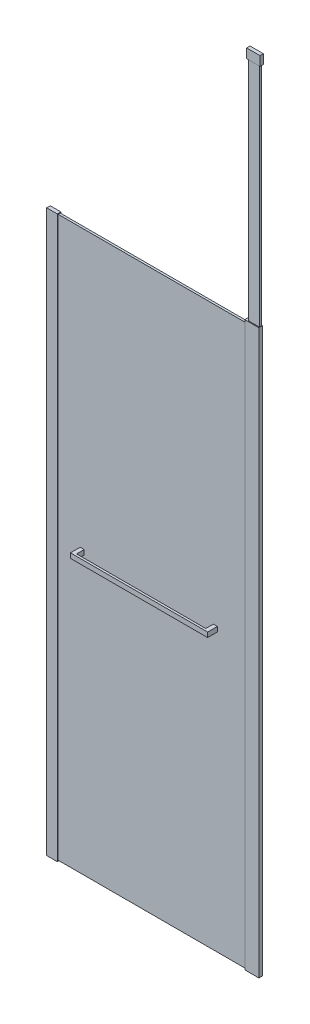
ISO-10303-21;
HEADER;
FILE_DESCRIPTION(('STEP AP214'),'2;1');
FILE_NAME('part.step','',(''),(''),'','','');
FILE_SCHEMA(('AUTOMOTIVE_DESIGN { 1 0 10303 214 1 1 1 1 }'));
ENDSEC;
DATA;
#1=APPLICATION_CONTEXT('core data for automotive mechanical design processes');
#2=APPLICATION_PROTOCOL_DEFINITION('international standard','automotive_design',2000,#1);
#3=PRODUCT_CONTEXT('',#1,'mechanical');
#4=PRODUCT('Part','Part','',(#3));
#5=PRODUCT_RELATED_PRODUCT_CATEGORY('part','',(#4));
#6=PRODUCT_DEFINITION_FORMATION('','',#4);
#7=PRODUCT_DEFINITION_CONTEXT('part definition',#1,'design');
#8=PRODUCT_DEFINITION('design','',#6,#7);
#9=PRODUCT_DEFINITION_SHAPE('','',#8);
#10=(LENGTH_UNIT() NAMED_UNIT(*) SI_UNIT(.MILLI.,.METRE.));
#11=(NAMED_UNIT(*) PLANE_ANGLE_UNIT() SI_UNIT($,.RADIAN.));
#12=(NAMED_UNIT(*) SI_UNIT($,.STERADIAN.) SOLID_ANGLE_UNIT());
#13=UNCERTAINTY_MEASURE_WITH_UNIT(LENGTH_MEASURE(1.E-05),#10,'distance_accuracy_value','');
#14=(GEOMETRIC_REPRESENTATION_CONTEXT(3) GLOBAL_UNCERTAINTY_ASSIGNED_CONTEXT((#13)) GLOBAL_UNIT_ASSIGNED_CONTEXT((#10,
#11,#12)) REPRESENTATION_CONTEXT('',''));
#15=CARTESIAN_POINT('',(0.,0.,0.));
#16=DIRECTION('',(0.,0.,1.));
#17=DIRECTION('',(1.,0.,0.));
#18=AXIS2_PLACEMENT_3D('',#15,#16,#17);
#19=CARTESIAN_POINT('',(137.5,1062.,-21.4));
#20=DIRECTION('',(1.,0.,0.));
#21=DIRECTION('',(0.,0.,-1.));
#22=AXIS2_PLACEMENT_3D('',#19,#20,#21);
#23=PLANE('',#22);
#24=DIRECTION('',(0.,1.,0.));
#25=VECTOR('',#24,1.);
#26=CARTESIAN_POINT('',(137.5,1062.,25.1));
#27=LINE('',#26,#25);
#28=CARTESIAN_POINT('',(137.5,1044.,25.1));
#29=VERTEX_POINT('',#28);
#30=CARTESIAN_POINT('',(137.5,1062.,25.1));
#31=VERTEX_POINT('',#30);
#32=EDGE_CURVE('E63',#29,#31,#27,.T.);
#33=ORIENTED_EDGE('',*,*,#32,.F.);
#34=DIRECTION('',(0.,0.,1.));
#35=VECTOR('',#34,1.);
#36=CARTESIAN_POINT('',(137.5,1044.,-21.4));
#37=LINE('',#36,#35);
#38=CARTESIAN_POINT('',(137.5,1044.,-21.4));
#39=VERTEX_POINT('',#38);
#40=EDGE_CURVE('E12',#39,#29,#37,.T.);
#41=ORIENTED_EDGE('',*,*,#40,.F.);
#42=DIRECTION('',(0.,1.,0.));
#43=VECTOR('',#42,1.);
#44=CARTESIAN_POINT('',(137.5,1062.,-21.4));
#45=LINE('',#44,#43);
#46=CARTESIAN_POINT('',(137.5,1062.,-21.4));
#47=VERTEX_POINT('',#46);
#48=EDGE_CURVE('E193',#39,#47,#45,.T.);
#49=ORIENTED_EDGE('',*,*,#48,.T.);
#50=DIRECTION('',(0.,0.,1.));
#51=VECTOR('',#50,1.);
#52=CARTESIAN_POINT('',(137.5,1062.,-21.4));
#53=LINE('',#52,#51);
#54=EDGE_CURVE('E176',#47,#31,#53,.T.);
#55=ORIENTED_EDGE('',*,*,#54,.T.);
#56=EDGE_LOOP('',(#33,#41,#49,#55));
#57=FACE_BOUND('',#56,.T.);
#58=ADVANCED_FACE('F46',(#57),#23,.T.);
#59=CARTESIAN_POINT('',(122.5,1044.,-21.4));
#60=DIRECTION('',(0.,-1.,0.));
#61=DIRECTION('',(0.,0.,-1.));
#62=AXIS2_PLACEMENT_3D('',#59,#60,#61);
#63=PLANE('',#62);
#64=ORIENTED_EDGE('',*,*,#40,.T.);
#65=DIRECTION('',(-1.,0.,0.));
#66=VECTOR('',#65,1.);
#67=CARTESIAN_POINT('',(642.197715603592,1044.,25.1));
#68=LINE('',#67,#66);
#69=CARTESIAN_POINT('',(622.5,1044.,25.1));
#70=VERTEX_POINT('',#69);
#71=EDGE_CURVE('E166',#70,#29,#68,.T.);
#72=ORIENTED_EDGE('',*,*,#71,.F.);
#73=DIRECTION('',(0.,0.,1.));
#74=VECTOR('',#73,1.);
#75=CARTESIAN_POINT('',(622.5,1044.,-21.4));
#76=LINE('',#75,#74);
#77=CARTESIAN_POINT('',(622.5,1044.,-21.4));
#78=VERTEX_POINT('',#77);
#79=EDGE_CURVE('E149',#78,#70,#76,.T.);
#80=ORIENTED_EDGE('',*,*,#79,.F.);
#81=DIRECTION('',(1.,0.,0.));
#82=VECTOR('',#81,1.);
#83=CARTESIAN_POINT('',(622.5,1044.,-21.4));
#84=LINE('',#83,#82);
#85=CARTESIAN_POINT('',(637.5,1044.,-21.4));
#86=VERTEX_POINT('',#85);
#87=EDGE_CURVE('E131',#78,#86,#84,.T.);
#88=ORIENTED_EDGE('',*,*,#87,.T.);
#89=DIRECTION('',(0.,0.,1.));
#90=VECTOR('',#89,1.);
#91=CARTESIAN_POINT('',(637.5,1044.,-21.4));
#92=LINE('',#91,#90);
#93=CARTESIAN_POINT('',(637.5,1044.,33.1));
#94=VERTEX_POINT('',#93);
#95=EDGE_CURVE('E147',#86,#94,#92,.T.);
#96=ORIENTED_EDGE('',*,*,#95,.T.);
#97=DIRECTION('',(1.,0.,0.));
#98=VECTOR('',#97,1.);
#99=CARTESIAN_POINT('',(122.5,1044.,33.1));
#100=LINE('',#99,#98);
#101=CARTESIAN_POINT('',(122.5,1044.,33.1));
#102=VERTEX_POINT('',#101);
#103=EDGE_CURVE('E135',#102,#94,#100,.T.);
#104=ORIENTED_EDGE('',*,*,#103,.F.);
#105=DIRECTION('',(0.,0.,1.));
#106=VECTOR('',#105,1.);
#107=CARTESIAN_POINT('',(122.5,1044.,-21.4));
#108=LINE('',#107,#106);
#109=CARTESIAN_POINT('',(122.5,1044.,-21.4));
#110=VERTEX_POINT('',#109);
#111=EDGE_CURVE('E55',#110,#102,#108,.T.);
#112=ORIENTED_EDGE('',*,*,#111,.F.);
#113=DIRECTION('',(1.,0.,0.));
#114=VECTOR('',#113,1.);
#115=CARTESIAN_POINT('',(122.5,1044.,-21.4));
#116=LINE('',#115,#114);
#117=EDGE_CURVE('E181',#110,#39,#116,.T.);
#118=ORIENTED_EDGE('',*,*,#117,.T.);
#119=EDGE_LOOP('',(#64,#72,#80,#88,#96,#104,#112,#118));
#120=FACE_BOUND('',#119,.T.);
#121=ADVANCED_FACE('F197',(#120),#63,.T.);
#122=CARTESIAN_POINT('',(122.5,1062.,-21.4));
#123=DIRECTION('',(-1.,0.,0.));
#124=DIRECTION('',(0.,0.,1.));
#125=AXIS2_PLACEMENT_3D('',#122,#123,#124);
#126=PLANE('',#125);
#127=ORIENTED_EDGE('',*,*,#111,.T.);
#128=DIRECTION('',(0.,-1.,0.));
#129=VECTOR('',#128,1.);
#130=CARTESIAN_POINT('',(122.5,1062.,33.1));
#131=LINE('',#130,#129);
#132=CARTESIAN_POINT('',(122.5,1062.,33.1));
#133=VERTEX_POINT('',#132);
#134=EDGE_CURVE('E121',#133,#102,#131,.T.);
#135=ORIENTED_EDGE('',*,*,#134,.F.);
#136=DIRECTION('',(0.,0.,1.));
#137=VECTOR('',#136,1.);
#138=CARTESIAN_POINT('',(122.5,1062.,-21.4));
#139=LINE('',#138,#137);
#140=CARTESIAN_POINT('',(122.5,1062.,-21.4));
#141=VERTEX_POINT('',#140);
#142=EDGE_CURVE('E116',#141,#133,#139,.T.);
#143=ORIENTED_EDGE('',*,*,#142,.F.);
#144=DIRECTION('',(0.,-1.,0.));
#145=VECTOR('',#144,1.);
#146=CARTESIAN_POINT('',(122.5,1062.,-21.4));
#147=LINE('',#146,#145);
#148=EDGE_CURVE('E186',#141,#110,#147,.T.);
#149=ORIENTED_EDGE('',*,*,#148,.T.);
#150=EDGE_LOOP('',(#127,#135,#143,#149));
#151=FACE_BOUND('',#150,.T.);
#152=ADVANCED_FACE('F218',(#151),#126,.T.);
#153=CARTESIAN_POINT('',(122.5,1062.,-21.4));
#154=DIRECTION('',(0.,1.,0.));
#155=DIRECTION('',(0.,0.,1.));
#156=AXIS2_PLACEMENT_3D('',#153,#154,#155);
#157=PLANE('',#156);
#158=ORIENTED_EDGE('',*,*,#142,.T.);
#159=DIRECTION('',(-1.,0.,0.));
#160=VECTOR('',#159,1.);
#161=CARTESIAN_POINT('',(122.5,1062.,33.1));
#162=LINE('',#161,#160);
#163=CARTESIAN_POINT('',(637.5,1062.,33.1));
#164=VERTEX_POINT('',#163);
#165=EDGE_CURVE('E109',#164,#133,#162,.T.);
#166=ORIENTED_EDGE('',*,*,#165,.F.);
#167=DIRECTION('',(0.,0.,1.));
#168=VECTOR('',#167,1.);
#169=CARTESIAN_POINT('',(637.5,1062.,-21.4));
#170=LINE('',#169,#168);
#171=CARTESIAN_POINT('',(637.5,1062.,-21.4));
#172=VERTEX_POINT('',#171);
#173=EDGE_CURVE('E113',#172,#164,#170,.T.);
#174=ORIENTED_EDGE('',*,*,#173,.F.);
#175=DIRECTION('',(-1.,0.,0.));
#176=VECTOR('',#175,1.);
#177=CARTESIAN_POINT('',(622.5,1062.,-21.4));
#178=LINE('',#177,#176);
#179=CARTESIAN_POINT('',(622.5,1062.,-21.4));
#180=VERTEX_POINT('',#179);
#181=EDGE_CURVE('E138',#172,#180,#178,.T.);
#182=ORIENTED_EDGE('',*,*,#181,.T.);
#183=DIRECTION('',(0.,0.,1.));
#184=VECTOR('',#183,1.);
#185=CARTESIAN_POINT('',(622.5,1062.,-21.4));
#186=LINE('',#185,#184);
#187=CARTESIAN_POINT('',(622.5,1062.,25.1));
#188=VERTEX_POINT('',#187);
#189=EDGE_CURVE('E130',#180,#188,#186,.T.);
#190=ORIENTED_EDGE('',*,*,#189,.T.);
#191=DIRECTION('',(-1.,0.,0.));
#192=VECTOR('',#191,1.);
#193=CARTESIAN_POINT('',(642.197715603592,1062.,25.1));
#194=LINE('',#193,#192);
#195=EDGE_CURVE('E163',#188,#31,#194,.T.);
#196=ORIENTED_EDGE('',*,*,#195,.T.);
#197=ORIENTED_EDGE('',*,*,#54,.F.);
#198=DIRECTION('',(-1.,0.,0.));
#199=VECTOR('',#198,1.);
#200=CARTESIAN_POINT('',(122.5,1062.,-21.4));
#201=LINE('',#200,#199);
#202=EDGE_CURVE('E190',#47,#141,#201,.T.);
#203=ORIENTED_EDGE('',*,*,#202,.T.);
#204=EDGE_LOOP('',(#158,#166,#174,#182,#190,#196,#197,#203));
#205=FACE_BOUND('',#204,.T.);
#206=ADVANCED_FACE('F111',(#205),#157,.T.);
#207=CARTESIAN_POINT('',(137.5,1044.,-21.4));
#208=DIRECTION('',(0.,0.,1.));
#209=DIRECTION('',(1.,0.,0.));
#210=AXIS2_PLACEMENT_3D('',#207,#208,#209);
#211=PLANE('',#210);
#212=ORIENTED_EDGE('',*,*,#48,.F.);
#213=ORIENTED_EDGE('',*,*,#117,.F.);
#214=ORIENTED_EDGE('',*,*,#148,.F.);
#215=ORIENTED_EDGE('',*,*,#202,.F.);
#216=EDGE_LOOP('',(#212,#213,#214,#215));
#217=FACE_BOUND('',#216,.T.);
#218=ADVANCED_FACE('F225',(#217),#211,.F.);
#219=CARTESIAN_POINT('',(137.5,1044.,33.1));
#220=DIRECTION('',(0.,0.,1.));
#221=DIRECTION('',(1.,0.,0.));
#222=AXIS2_PLACEMENT_3D('',#219,#220,#221);
#223=PLANE('',#222);
#224=ORIENTED_EDGE('',*,*,#103,.T.);
#225=DIRECTION('',(0.,1.,0.));
#226=VECTOR('',#225,1.);
#227=CARTESIAN_POINT('',(637.5,1062.,33.1));
#228=LINE('',#227,#226);
#229=EDGE_CURVE('E127',#94,#164,#228,.T.);
#230=ORIENTED_EDGE('',*,*,#229,.T.);
#231=ORIENTED_EDGE('',*,*,#165,.T.);
#232=ORIENTED_EDGE('',*,*,#134,.T.);
#233=EDGE_LOOP('',(#224,#230,#231,#232));
#234=FACE_BOUND('',#233,.T.);
#235=ADVANCED_FACE('F133',(#234),#223,.T.);
#236=CARTESIAN_POINT('',(642.197715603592,1062.,25.1));
#237=DIRECTION('',(0.,0.,1.));
#238=DIRECTION('',(1.,0.,0.));
#239=AXIS2_PLACEMENT_3D('',#236,#237,#238);
#240=PLANE('',#239);
#241=ORIENTED_EDGE('',*,*,#195,.F.);
#242=DIRECTION('',(0.,-1.,0.));
#243=VECTOR('',#242,1.);
#244=CARTESIAN_POINT('',(622.5,1062.,25.1));
#245=LINE('',#244,#243);
#246=EDGE_CURVE('E49',#188,#70,#245,.T.);
#247=ORIENTED_EDGE('',*,*,#246,.T.);
#248=ORIENTED_EDGE('',*,*,#71,.T.);
#249=ORIENTED_EDGE('',*,*,#32,.T.);
#250=EDGE_LOOP('',(#241,#247,#248,#249));
#251=FACE_BOUND('',#250,.T.);
#252=ADVANCED_FACE('F203',(#251),#240,.F.);
#253=CARTESIAN_POINT('',(622.5,1062.,-21.4));
#254=DIRECTION('',(-1.,0.,0.));
#255=DIRECTION('',(0.,0.,1.));
#256=AXIS2_PLACEMENT_3D('',#253,#254,#255);
#257=PLANE('',#256);
#258=ORIENTED_EDGE('',*,*,#246,.F.);
#259=ORIENTED_EDGE('',*,*,#189,.F.);
#260=DIRECTION('',(0.,-1.,0.));
#261=VECTOR('',#260,1.);
#262=CARTESIAN_POINT('',(622.5,1062.,-21.4));
#263=LINE('',#262,#261);
#264=EDGE_CURVE('E142',#180,#78,#263,.T.);
#265=ORIENTED_EDGE('',*,*,#264,.T.);
#266=ORIENTED_EDGE('',*,*,#79,.T.);
#267=EDGE_LOOP('',(#258,#259,#265,#266));
#268=FACE_BOUND('',#267,.T.);
#269=ADVANCED_FACE('F204',(#268),#257,.T.);
#270=CARTESIAN_POINT('',(637.5,1062.,-21.4));
#271=DIRECTION('',(1.,0.,0.));
#272=DIRECTION('',(0.,0.,-1.));
#273=AXIS2_PLACEMENT_3D('',#270,#271,#272);
#274=PLANE('',#273);
#275=ORIENTED_EDGE('',*,*,#173,.T.);
#276=ORIENTED_EDGE('',*,*,#229,.F.);
#277=ORIENTED_EDGE('',*,*,#95,.F.);
#278=DIRECTION('',(0.,1.,0.));
#279=VECTOR('',#278,1.);
#280=CARTESIAN_POINT('',(637.5,1062.,-21.4));
#281=LINE('',#280,#279);
#282=EDGE_CURVE('E129',#86,#172,#281,.T.);
#283=ORIENTED_EDGE('',*,*,#282,.T.);
#284=EDGE_LOOP('',(#275,#276,#277,#283));
#285=FACE_BOUND('',#284,.T.);
#286=ADVANCED_FACE('F126',(#285),#274,.T.);
#287=CARTESIAN_POINT('',(637.5,1044.,-21.4));
#288=DIRECTION('',(0.,0.,1.));
#289=DIRECTION('',(1.,0.,0.));
#290=AXIS2_PLACEMENT_3D('',#287,#288,#289);
#291=PLANE('',#290);
#292=ORIENTED_EDGE('',*,*,#282,.F.);
#293=ORIENTED_EDGE('',*,*,#87,.F.);
#294=ORIENTED_EDGE('',*,*,#264,.F.);
#295=ORIENTED_EDGE('',*,*,#181,.F.);
#296=EDGE_LOOP('',(#292,#293,#294,#295));
#297=FACE_BOUND('',#296,.T.);
#298=ADVANCED_FACE('F200',(#297),#291,.F.);
#299=CLOSED_SHELL('',(#58,#121,#152,#206,#218,#235,#252,#269,#286,#298));
#300=MANIFOLD_SOLID_BREP('B2',#299);
#301=CARTESIAN_POINT('',(749.9,3000.,-1.14999999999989));
#302=DIRECTION('',(1.,0.,0.));
#303=DIRECTION('',(0.,1.,0.));
#304=AXIS2_PLACEMENT_3D('',#301,#302,#303);
#305=PLANE('',#304);
#306=DIRECTION('',(0.,0.,1.));
#307=VECTOR('',#306,1.);
#308=CARTESIAN_POINT('',(749.9,2965.,-1.14999999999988));
#309=LINE('',#308,#307);
#310=CARTESIAN_POINT('',(749.9,2965.,-13.6500000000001));
#311=VERTEX_POINT('',#310);
#312=CARTESIAN_POINT('',(749.9,2965.,-1.14999999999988));
#313=VERTEX_POINT('',#312);
#314=EDGE_CURVE('E406',#311,#313,#309,.T.);
#315=ORIENTED_EDGE('',*,*,#314,.T.);
#316=DIRECTION('',(0.,-1.,0.));
#317=VECTOR('',#316,1.);
#318=CARTESIAN_POINT('',(749.9,3000.,-1.14999999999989));
#319=LINE('',#318,#317);
#320=CARTESIAN_POINT('',(749.9,3000.,-1.14999999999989));
#321=VERTEX_POINT('',#320);
#322=EDGE_CURVE('E387',#321,#313,#319,.T.);
#323=ORIENTED_EDGE('',*,*,#322,.F.);
#324=DIRECTION('',(0.,0.,1.));
#325=VECTOR('',#324,1.);
#326=CARTESIAN_POINT('',(749.9,3000.,-1.14999999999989));
#327=LINE('',#326,#325);
#328=CARTESIAN_POINT('',(749.9,3000.,-13.6500000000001));
#329=VERTEX_POINT('',#328);
#330=EDGE_CURVE('E394',#329,#321,#327,.T.);
#331=ORIENTED_EDGE('',*,*,#330,.F.);
#332=DIRECTION('',(0.,-1.,0.));
#333=VECTOR('',#332,1.);
#334=CARTESIAN_POINT('',(749.9,3000.,-13.6500000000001));
#335=LINE('',#334,#333);
#336=EDGE_CURVE('E545',#329,#311,#335,.T.);
#337=ORIENTED_EDGE('',*,*,#336,.T.);
#338=EDGE_LOOP('',(#315,#323,#331,#337));
#339=FACE_BOUND('',#338,.T.);
#340=ADVANCED_FACE('F318',(#339),#305,.F.);
#341=CARTESIAN_POINT('',(799.9,3000.,-1.14999999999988));
#342=DIRECTION('',(0.,0.,-1.));
#343=DIRECTION('',(-1.,0.,0.));
#344=AXIS2_PLACEMENT_3D('',#341,#342,#343);
#345=PLANE('',#344);
#346=DIRECTION('',(1.,0.,0.));
#347=VECTOR('',#346,1.);
#348=CARTESIAN_POINT('',(799.9,2965.,-1.14999999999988));
#349=LINE('',#348,#347);
#350=CARTESIAN_POINT('',(799.9,2965.,-1.14999999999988));
#351=VERTEX_POINT('',#350);
#352=EDGE_CURVE('E543',#313,#351,#349,.T.);
#353=ORIENTED_EDGE('',*,*,#352,.T.);
#354=DIRECTION('',(0.,-1.,0.));
#355=VECTOR('',#354,1.);
#356=CARTESIAN_POINT('',(799.9,3000.,-1.14999999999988));
#357=LINE('',#356,#355);
#358=CARTESIAN_POINT('',(799.9,3000.,-1.14999999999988));
#359=VERTEX_POINT('',#358);
#360=EDGE_CURVE('E390',#359,#351,#357,.T.);
#361=ORIENTED_EDGE('',*,*,#360,.F.);
#362=DIRECTION('',(1.,0.,0.));
#363=VECTOR('',#362,1.);
#364=CARTESIAN_POINT('',(799.9,3000.,-1.14999999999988));
#365=LINE('',#364,#363);
#366=EDGE_CURVE('E383',#321,#359,#365,.T.);
#367=ORIENTED_EDGE('',*,*,#366,.F.);
#368=ORIENTED_EDGE('',*,*,#322,.T.);
#369=EDGE_LOOP('',(#353,#361,#367,#368));
#370=FACE_BOUND('',#369,.T.);
#371=ADVANCED_FACE('F385',(#370),#345,.F.);
#372=CARTESIAN_POINT('',(799.9,3000.,-1.14999999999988));
#373=DIRECTION('',(-1.,0.,0.));
#374=DIRECTION('',(0.,-1.,0.));
#375=AXIS2_PLACEMENT_3D('',#372,#373,#374);
#376=PLANE('',#375);
#377=DIRECTION('',(0.,0.,-1.));
#378=VECTOR('',#377,1.);
#379=CARTESIAN_POINT('',(799.9,2965.,-1.14999999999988));
#380=LINE('',#379,#378);
#381=CARTESIAN_POINT('',(799.9,2965.,-13.6500000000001));
#382=VERTEX_POINT('',#381);
#383=EDGE_CURVE('E539',#351,#382,#380,.T.);
#384=ORIENTED_EDGE('',*,*,#383,.T.);
#385=DIRECTION('',(0.,-1.,0.));
#386=VECTOR('',#385,1.);
#387=CARTESIAN_POINT('',(799.9,3000.,-13.6500000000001));
#388=LINE('',#387,#386);
#389=CARTESIAN_POINT('',(799.9,3000.,-13.6500000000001));
#390=VERTEX_POINT('',#389);
#391=EDGE_CURVE('E410',#390,#382,#388,.T.);
#392=ORIENTED_EDGE('',*,*,#391,.F.);
#393=DIRECTION('',(0.,0.,-1.));
#394=VECTOR('',#393,1.);
#395=CARTESIAN_POINT('',(799.9,3000.,-1.14999999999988));
#396=LINE('',#395,#394);
#397=EDGE_CURVE('E393',#359,#390,#396,.T.);
#398=ORIENTED_EDGE('',*,*,#397,.F.);
#399=ORIENTED_EDGE('',*,*,#360,.T.);
#400=EDGE_LOOP('',(#384,#392,#398,#399));
#401=FACE_BOUND('',#400,.T.);
#402=ADVANCED_FACE('F460',(#401),#376,.F.);
#403=CARTESIAN_POINT('',(799.9,3000.,-13.6500000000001));
#404=DIRECTION('',(0.,0.,1.));
#405=DIRECTION('',(1.,0.,0.));
#406=AXIS2_PLACEMENT_3D('',#403,#404,#405);
#407=PLANE('',#406);
#408=DIRECTION('',(-1.,0.,0.));
#409=VECTOR('',#408,1.);
#410=CARTESIAN_POINT('',(799.9,2965.,-13.6500000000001));
#411=LINE('',#410,#409);
#412=EDGE_CURVE('E403',#382,#311,#411,.T.);
#413=ORIENTED_EDGE('',*,*,#412,.T.);
#414=ORIENTED_EDGE('',*,*,#336,.F.);
#415=DIRECTION('',(-1.,0.,0.));
#416=VECTOR('',#415,1.);
#417=CARTESIAN_POINT('',(799.9,3000.,-13.6500000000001));
#418=LINE('',#417,#416);
#419=EDGE_CURVE('E399',#390,#329,#418,.T.);
#420=ORIENTED_EDGE('',*,*,#419,.F.);
#421=ORIENTED_EDGE('',*,*,#391,.T.);
#422=EDGE_LOOP('',(#413,#414,#420,#421));
#423=FACE_BOUND('',#422,.T.);
#424=ADVANCED_FACE('F507',(#423),#407,.F.);
#425=CARTESIAN_POINT('',(749.9,3000.,-13.6500000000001));
#426=DIRECTION('',(0.,1.,0.));
#427=DIRECTION('',(0.,0.,1.));
#428=AXIS2_PLACEMENT_3D('',#425,#426,#427);
#429=PLANE('',#428);
#430=ORIENTED_EDGE('',*,*,#330,.T.);
#431=ORIENTED_EDGE('',*,*,#366,.T.);
#432=ORIENTED_EDGE('',*,*,#397,.T.);
#433=ORIENTED_EDGE('',*,*,#419,.T.);
#434=EDGE_LOOP('',(#430,#431,#432,#433));
#435=FACE_BOUND('',#434,.T.);
#436=ADVANCED_FACE('F397',(#435),#429,.T.);
#437=CARTESIAN_POINT('',(749.9,2965.,-13.6500000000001));
#438=DIRECTION('',(0.,1.,0.));
#439=DIRECTION('',(0.,0.,1.));
#440=AXIS2_PLACEMENT_3D('',#437,#438,#439);
#441=PLANE('',#440);
#442=DIRECTION('',(0.,0.,1.));
#443=VECTOR('',#442,1.);
#444=CARTESIAN_POINT('',(794.9,2965.,-11.4000000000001));
#445=LINE('',#444,#443);
#446=CARTESIAN_POINT('',(794.9,2965.,-11.4000000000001));
#447=VERTEX_POINT('',#446);
#448=CARTESIAN_POINT('',(794.9,2965.,-3.40000000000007));
#449=VERTEX_POINT('',#448);
#450=EDGE_CURVE('E415',#447,#449,#445,.T.);
#451=ORIENTED_EDGE('',*,*,#450,.F.);
#452=DIRECTION('',(1.,0.,0.));
#453=VECTOR('',#452,1.);
#454=CARTESIAN_POINT('',(794.9,2965.,-11.4000000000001));
#455=LINE('',#454,#453);
#456=CARTESIAN_POINT('',(754.9,2965.,-11.4000000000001));
#457=VERTEX_POINT('',#456);
#458=EDGE_CURVE('E408',#457,#447,#455,.T.);
#459=ORIENTED_EDGE('',*,*,#458,.F.);
#460=DIRECTION('',(0.,0.,-1.));
#461=VECTOR('',#460,1.);
#462=CARTESIAN_POINT('',(754.9,2965.,-11.4000000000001));
#463=LINE('',#462,#461);
#464=CARTESIAN_POINT('',(754.9,2965.,-3.40000000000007));
#465=VERTEX_POINT('',#464);
#466=EDGE_CURVE('E333',#465,#457,#463,.T.);
#467=ORIENTED_EDGE('',*,*,#466,.F.);
#468=DIRECTION('',(-1.,0.,0.));
#469=VECTOR('',#468,1.);
#470=CARTESIAN_POINT('',(794.9,2965.,-3.40000000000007));
#471=LINE('',#470,#469);
#472=EDGE_CURVE('E44',#449,#465,#471,.T.);
#473=ORIENTED_EDGE('',*,*,#472,.F.);
#474=EDGE_LOOP('',(#451,#459,#467,#473));
#475=FACE_BOUND('',#474,.T.);
#476=ORIENTED_EDGE('',*,*,#314,.F.);
#477=ORIENTED_EDGE('',*,*,#412,.F.);
#478=ORIENTED_EDGE('',*,*,#383,.F.);
#479=ORIENTED_EDGE('',*,*,#352,.F.);
#480=EDGE_LOOP('',(#476,#477,#478,#479));
#481=FACE_BOUND('',#480,.T.);
#482=ADVANCED_FACE('F490',(#475,#481),#441,.F.);
#483=CARTESIAN_POINT('',(794.9,2997.,-11.4000000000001));
#484=DIRECTION('',(1.,0.,0.));
#485=DIRECTION('',(0.,0.,-1.));
#486=AXIS2_PLACEMENT_3D('',#483,#484,#485);
#487=PLANE('',#486);
#488=DIRECTION('',(0.,-1.,0.));
#489=VECTOR('',#488,1.);
#490=CARTESIAN_POINT('',(794.9,2997.,-11.4000000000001));
#491=LINE('',#490,#489);
#492=CARTESIAN_POINT('',(794.9,2114.,-11.4000000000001));
#493=VERTEX_POINT('',#492);
#494=EDGE_CURVE('E326',#447,#493,#491,.T.);
#495=ORIENTED_EDGE('',*,*,#494,.F.);
#496=ORIENTED_EDGE('',*,*,#450,.T.);
#497=DIRECTION('',(0.,-1.,0.));
#498=VECTOR('',#497,1.);
#499=CARTESIAN_POINT('',(794.9,2997.,-3.40000000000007));
#500=LINE('',#499,#498);
#501=CARTESIAN_POINT('',(794.9,2114.,-3.40000000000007));
#502=VERTEX_POINT('',#501);
#503=EDGE_CURVE('E430',#449,#502,#500,.T.);
#504=ORIENTED_EDGE('',*,*,#503,.T.);
#505=DIRECTION('',(0.,0.,1.));
#506=VECTOR('',#505,1.);
#507=CARTESIAN_POINT('',(794.9,2114.,-11.4000000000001));
#508=LINE('',#507,#506);
#509=EDGE_CURVE('E418',#493,#502,#508,.T.);
#510=ORIENTED_EDGE('',*,*,#509,.F.);
#511=EDGE_LOOP('',(#495,#496,#504,#510));
#512=FACE_BOUND('',#511,.T.);
#513=ADVANCED_FACE('F320',(#512),#487,.T.);
#514=CARTESIAN_POINT('',(794.9,2997.,-11.4000000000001));
#515=DIRECTION('',(0.,0.,-1.));
#516=DIRECTION('',(-1.,0.,0.));
#517=AXIS2_PLACEMENT_3D('',#514,#515,#516);
#518=PLANE('',#517);
#519=DIRECTION('',(0.,-1.,0.));
#520=VECTOR('',#519,1.);
#521=CARTESIAN_POINT('',(754.9,2997.,-11.4000000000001));
#522=LINE('',#521,#520);
#523=CARTESIAN_POINT('',(754.9,2114.,-11.4000000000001));
#524=VERTEX_POINT('',#523);
#525=EDGE_CURVE('E432',#457,#524,#522,.T.);
#526=ORIENTED_EDGE('',*,*,#525,.F.);
#527=ORIENTED_EDGE('',*,*,#458,.T.);
#528=ORIENTED_EDGE('',*,*,#494,.T.);
#529=DIRECTION('',(1.,0.,0.));
#530=VECTOR('',#529,1.);
#531=CARTESIAN_POINT('',(794.9,2114.,-11.4000000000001));
#532=LINE('',#531,#530);
#533=EDGE_CURVE('E427',#524,#493,#532,.T.);
#534=ORIENTED_EDGE('',*,*,#533,.F.);
#535=EDGE_LOOP('',(#526,#527,#528,#534));
#536=FACE_BOUND('',#535,.T.);
#537=ADVANCED_FACE('F445',(#536),#518,.T.);
#538=CARTESIAN_POINT('',(754.9,2997.,-11.4000000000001));
#539=DIRECTION('',(-1.,0.,0.));
#540=DIRECTION('',(0.,0.,1.));
#541=AXIS2_PLACEMENT_3D('',#538,#539,#540);
#542=PLANE('',#541);
#543=DIRECTION('',(0.,-1.,0.));
#544=VECTOR('',#543,1.);
#545=CARTESIAN_POINT('',(754.9,2997.,-3.40000000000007));
#546=LINE('',#545,#544);
#547=CARTESIAN_POINT('',(754.9,2114.,-3.40000000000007));
#548=VERTEX_POINT('',#547);
#549=EDGE_CURVE('E434',#465,#548,#546,.T.);
#550=ORIENTED_EDGE('',*,*,#549,.F.);
#551=ORIENTED_EDGE('',*,*,#466,.T.);
#552=ORIENTED_EDGE('',*,*,#525,.T.);
#553=DIRECTION('',(0.,0.,-1.));
#554=VECTOR('',#553,1.);
#555=CARTESIAN_POINT('',(754.9,2114.,-11.4000000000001));
#556=LINE('',#555,#554);
#557=EDGE_CURVE('E424',#548,#524,#556,.T.);
#558=ORIENTED_EDGE('',*,*,#557,.F.);
#559=EDGE_LOOP('',(#550,#551,#552,#558));
#560=FACE_BOUND('',#559,.T.);
#561=ADVANCED_FACE('F447',(#560),#542,.T.);
#562=CARTESIAN_POINT('',(794.9,2997.,-3.40000000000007));
#563=DIRECTION('',(0.,0.,1.));
#564=DIRECTION('',(1.,0.,0.));
#565=AXIS2_PLACEMENT_3D('',#562,#563,#564);
#566=PLANE('',#565);
#567=ORIENTED_EDGE('',*,*,#503,.F.);
#568=ORIENTED_EDGE('',*,*,#472,.T.);
#569=ORIENTED_EDGE('',*,*,#549,.T.);
#570=DIRECTION('',(-1.,0.,0.));
#571=VECTOR('',#570,1.);
#572=CARTESIAN_POINT('',(794.9,2114.,-3.40000000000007));
#573=LINE('',#572,#571);
#574=EDGE_CURVE('E421',#502,#548,#573,.T.);
#575=ORIENTED_EDGE('',*,*,#574,.F.);
#576=EDGE_LOOP('',(#567,#568,#569,#575));
#577=FACE_BOUND('',#576,.T.);
#578=ADVANCED_FACE('F439',(#577),#566,.T.);
#579=CARTESIAN_POINT('',(794.9,2114.,-3.40000000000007));
#580=DIRECTION('',(0.,-1.,0.));
#581=DIRECTION('',(0.,0.,-1.));
#582=AXIS2_PLACEMENT_3D('',#579,#580,#581);
#583=PLANE('',#582);
#584=ORIENTED_EDGE('',*,*,#509,.T.);
#585=ORIENTED_EDGE('',*,*,#574,.T.);
#586=ORIENTED_EDGE('',*,*,#557,.T.);
#587=ORIENTED_EDGE('',*,*,#533,.T.);
#588=EDGE_LOOP('',(#584,#585,#586,#587));
#589=FACE_BOUND('',#588,.T.);
#590=ADVANCED_FACE('F443',(#589),#583,.T.);
#591=CLOSED_SHELL('',(#340,#371,#402,#424,#436,#482,#513,#537,#561,#578,#590));
#592=MANIFOLD_SOLID_BREP('B6',#591);
#593=CARTESIAN_POINT('',(753.5,2111.,-3.39999999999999));
#594=DIRECTION('',(0.,0.,-1.));
#595=DIRECTION('',(-1.,0.,0.));
#596=AXIS2_PLACEMENT_3D('',#593,#594,#595);
#597=PLANE('',#596);
#598=DIRECTION('',(-1.,0.,0.));
#599=VECTOR('',#598,1.);
#600=CARTESIAN_POINT('',(753.5,2103.2,-3.39999999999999));
#601=LINE('',#600,#599);
#602=CARTESIAN_POINT('',(753.5,2103.2,-3.39999999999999));
#603=VERTEX_POINT('',#602);
#604=CARTESIAN_POINT('',(743.4,2103.2,-3.39999999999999));
#605=VERTEX_POINT('',#604);
#606=EDGE_CURVE('E672',#603,#605,#601,.T.);
#607=ORIENTED_EDGE('',*,*,#606,.F.);
#608=DIRECTION('',(0.,-1.,0.));
#609=VECTOR('',#608,1.);
#610=CARTESIAN_POINT('',(753.5,2111.,-3.39999999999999));
#611=LINE('',#610,#609);
#612=CARTESIAN_POINT('',(753.5,3.,-3.39999999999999));
#613=VERTEX_POINT('',#612);
#614=EDGE_CURVE('E695',#603,#613,#611,.T.);
#615=ORIENTED_EDGE('',*,*,#614,.T.);
#616=DIRECTION('',(1.,0.,0.));
#617=VECTOR('',#616,1.);
#618=CARTESIAN_POINT('',(753.5,3.,-3.39999999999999));
#619=LINE('',#618,#617);
#620=CARTESIAN_POINT('',(743.4,3.,-3.39999999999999));
#621=VERTEX_POINT('',#620);
#622=EDGE_CURVE('E683',#621,#613,#619,.T.);
#623=ORIENTED_EDGE('',*,*,#622,.F.);
#624=DIRECTION('',(0.,-1.,0.));
#625=VECTOR('',#624,1.);
#626=CARTESIAN_POINT('',(743.4,2111.,-3.39999999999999));
#627=LINE('',#626,#625);
#628=EDGE_CURVE('E575',#605,#621,#627,.T.);
#629=ORIENTED_EDGE('',*,*,#628,.F.);
#630=EDGE_LOOP('',(#607,#615,#623,#629));
#631=FACE_BOUND('',#630,.T.);
#632=ADVANCED_FACE('F567',(#631),#597,.T.);
#633=CARTESIAN_POINT('',(743.4,2111.,-3.39999999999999));
#634=DIRECTION('',(-1.,0.,0.));
#635=DIRECTION('',(0.,0.,1.));
#636=AXIS2_PLACEMENT_3D('',#633,#634,#635);
#637=PLANE('',#636);
#638=DIRECTION('',(0.,-1.,0.));
#639=VECTOR('',#638,1.);
#640=CARTESIAN_POINT('',(743.4,2111.,-14.4));
#641=LINE('',#640,#639);
#642=CARTESIAN_POINT('',(743.4,2114.,-14.4));
#643=VERTEX_POINT('',#642);
#644=CARTESIAN_POINT('',(743.4,0.,-14.4));
#645=VERTEX_POINT('',#644);
#646=EDGE_CURVE('E635',#643,#645,#641,.T.);
#647=ORIENTED_EDGE('',*,*,#646,.T.);
#648=DIRECTION('',(0.,0.,-1.));
#649=VECTOR('',#648,1.);
#650=CARTESIAN_POINT('',(743.4,0.,-0.399999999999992));
#651=LINE('',#650,#649);
#652=CARTESIAN_POINT('',(743.4,0.,-0.399999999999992));
#653=VERTEX_POINT('',#652);
#654=EDGE_CURVE('E639',#653,#645,#651,.T.);
#655=ORIENTED_EDGE('',*,*,#654,.F.);
#656=DIRECTION('',(0.,-1.,0.));
#657=VECTOR('',#656,1.);
#658=CARTESIAN_POINT('',(743.4,2111.,-0.399999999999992));
#659=LINE('',#658,#657);
#660=CARTESIAN_POINT('',(743.4,2114.,-0.399999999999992));
#661=VERTEX_POINT('',#660);
#662=EDGE_CURVE('E690',#661,#653,#659,.T.);
#663=ORIENTED_EDGE('',*,*,#662,.F.);
#664=DIRECTION('',(0.,0.,1.));
#665=VECTOR('',#664,1.);
#666=CARTESIAN_POINT('',(743.4,2114.,-14.4));
#667=LINE('',#666,#665);
#668=EDGE_CURVE('E641',#643,#661,#667,.T.);
#669=ORIENTED_EDGE('',*,*,#668,.F.);
#670=EDGE_LOOP('',(#647,#655,#663,#669));
#671=FACE_BOUND('',#670,.T.);
#672=DIRECTION('',(0.,0.,1.));
#673=VECTOR('',#672,1.);
#674=CARTESIAN_POINT('',(743.4,2103.2,-3.34999999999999));
#675=LINE('',#674,#673);
#676=CARTESIAN_POINT('',(743.4,2103.2,-11.4));
#677=VERTEX_POINT('',#676);
#678=EDGE_CURVE('E666',#677,#605,#675,.T.);
#679=ORIENTED_EDGE('',*,*,#678,.T.);
#680=ORIENTED_EDGE('',*,*,#628,.T.);
#681=DIRECTION('',(0.,0.,-1.));
#682=VECTOR('',#681,1.);
#683=CARTESIAN_POINT('',(743.4,3.,-0.399999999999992));
#684=LINE('',#683,#682);
#685=CARTESIAN_POINT('',(743.4,3.,-11.4));
#686=VERTEX_POINT('',#685);
#687=EDGE_CURVE('E660',#621,#686,#684,.T.);
#688=ORIENTED_EDGE('',*,*,#687,.T.);
#689=DIRECTION('',(0.,-1.,0.));
#690=VECTOR('',#689,1.);
#691=CARTESIAN_POINT('',(743.4,2111.,-11.4));
#692=LINE('',#691,#690);
#693=EDGE_CURVE('E646',#677,#686,#692,.T.);
#694=ORIENTED_EDGE('',*,*,#693,.F.);
#695=EDGE_LOOP('',(#679,#680,#688,#694));
#696=FACE_BOUND('',#695,.T.);
#697=ADVANCED_FACE('F637',(#671,#696),#637,.T.);
#698=CARTESIAN_POINT('',(743.4,2111.,-0.399999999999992));
#699=DIRECTION('',(0.,0.,1.));
#700=DIRECTION('',(1.,0.,0.));
#701=AXIS2_PLACEMENT_3D('',#698,#699,#700);
#702=PLANE('',#701);
#703=ORIENTED_EDGE('',*,*,#662,.T.);
#704=DIRECTION('',(-1.,0.,0.));
#705=VECTOR('',#704,1.);
#706=CARTESIAN_POINT('',(743.4,0.,-0.399999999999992));
#707=LINE('',#706,#705);
#708=CARTESIAN_POINT('',(796.4,0.,-0.399999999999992));
#709=VERTEX_POINT('',#708);
#710=EDGE_CURVE('E659',#709,#653,#707,.T.);
#711=ORIENTED_EDGE('',*,*,#710,.F.);
#712=DIRECTION('',(0.,-1.,0.));
#713=VECTOR('',#712,1.);
#714=CARTESIAN_POINT('',(796.4,2111.,-0.399999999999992));
#715=LINE('',#714,#713);
#716=CARTESIAN_POINT('',(796.4,2114.,-0.399999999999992));
#717=VERTEX_POINT('',#716);
#718=EDGE_CURVE('E782',#717,#709,#715,.T.);
#719=ORIENTED_EDGE('',*,*,#718,.F.);
#720=DIRECTION('',(1.,0.,0.));
#721=VECTOR('',#720,1.);
#722=CARTESIAN_POINT('',(796.4,2114.,-0.399999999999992));
#723=LINE('',#722,#721);
#724=EDGE_CURVE('E680',#661,#717,#723,.T.);
#725=ORIENTED_EDGE('',*,*,#724,.F.);
#726=EDGE_LOOP('',(#703,#711,#719,#725));
#727=FACE_BOUND('',#726,.T.);
#728=ADVANCED_FACE('F723',(#727),#702,.T.);
#729=CARTESIAN_POINT('',(796.4,2111.,-0.399999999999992));
#730=DIRECTION('',(1.,0.,0.));
#731=DIRECTION('',(0.,0.,-1.));
#732=AXIS2_PLACEMENT_3D('',#729,#730,#731);
#733=PLANE('',#732);
#734=ORIENTED_EDGE('',*,*,#718,.T.);
#735=DIRECTION('',(0.,0.,1.));
#736=VECTOR('',#735,1.);
#737=CARTESIAN_POINT('',(796.4,0.,-0.399999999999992));
#738=LINE('',#737,#736);
#739=CARTESIAN_POINT('',(796.4,0.,-14.4));
#740=VERTEX_POINT('',#739);
#741=EDGE_CURVE('E654',#740,#709,#738,.T.);
#742=ORIENTED_EDGE('',*,*,#741,.F.);
#743=DIRECTION('',(0.,-1.,0.));
#744=VECTOR('',#743,1.);
#745=CARTESIAN_POINT('',(796.4,2111.,-14.4));
#746=LINE('',#745,#744);
#747=CARTESIAN_POINT('',(796.4,2114.,-14.4));
#748=VERTEX_POINT('',#747);
#749=EDGE_CURVE('E645',#748,#740,#746,.T.);
#750=ORIENTED_EDGE('',*,*,#749,.F.);
#751=DIRECTION('',(0.,0.,-1.));
#752=VECTOR('',#751,1.);
#753=CARTESIAN_POINT('',(796.4,2114.,-14.4));
#754=LINE('',#753,#752);
#755=EDGE_CURVE('E674',#717,#748,#754,.T.);
#756=ORIENTED_EDGE('',*,*,#755,.F.);
#757=EDGE_LOOP('',(#734,#742,#750,#756));
#758=FACE_BOUND('',#757,.T.);
#759=ADVANCED_FACE('F728',(#758),#733,.T.);
#760=CARTESIAN_POINT('',(796.4,2111.,-14.4));
#761=DIRECTION('',(0.,0.,-1.));
#762=DIRECTION('',(-1.,0.,0.));
#763=AXIS2_PLACEMENT_3D('',#760,#761,#762);
#764=PLANE('',#763);
#765=ORIENTED_EDGE('',*,*,#749,.T.);
#766=DIRECTION('',(1.,0.,0.));
#767=VECTOR('',#766,1.);
#768=CARTESIAN_POINT('',(743.4,0.,-14.4));
#769=LINE('',#768,#767);
#770=EDGE_CURVE('E649',#645,#740,#769,.T.);
#771=ORIENTED_EDGE('',*,*,#770,.F.);
#772=ORIENTED_EDGE('',*,*,#646,.F.);
#773=DIRECTION('',(-1.,0.,0.));
#774=VECTOR('',#773,1.);
#775=CARTESIAN_POINT('',(796.4,2114.,-14.4));
#776=LINE('',#775,#774);
#777=EDGE_CURVE('E677',#748,#643,#776,.T.);
#778=ORIENTED_EDGE('',*,*,#777,.F.);
#779=EDGE_LOOP('',(#765,#771,#772,#778));
#780=FACE_BOUND('',#779,.T.);
#781=ADVANCED_FACE('F650',(#780),#764,.T.);
#782=CARTESIAN_POINT('',(743.4,2111.,-11.4));
#783=DIRECTION('',(0.,0.,1.));
#784=DIRECTION('',(1.,0.,0.));
#785=AXIS2_PLACEMENT_3D('',#782,#783,#784);
#786=PLANE('',#785);
#787=DIRECTION('',(1.,0.,0.));
#788=VECTOR('',#787,1.);
#789=CARTESIAN_POINT('',(743.4,2103.2,-11.4));
#790=LINE('',#789,#788);
#791=CARTESIAN_POINT('',(753.5,2103.2,-11.4));
#792=VERTEX_POINT('',#791);
#793=EDGE_CURVE('E670',#677,#792,#790,.T.);
#794=ORIENTED_EDGE('',*,*,#793,.F.);
#795=ORIENTED_EDGE('',*,*,#693,.T.);
#796=DIRECTION('',(-1.,0.,0.));
#797=VECTOR('',#796,1.);
#798=CARTESIAN_POINT('',(743.4,3.,-11.4));
#799=LINE('',#798,#797);
#800=CARTESIAN_POINT('',(753.5,3.,-11.4));
#801=VERTEX_POINT('',#800);
#802=EDGE_CURVE('E687',#801,#686,#799,.T.);
#803=ORIENTED_EDGE('',*,*,#802,.F.);
#804=DIRECTION('',(0.,-1.,0.));
#805=VECTOR('',#804,1.);
#806=CARTESIAN_POINT('',(753.5,2111.,-11.4));
#807=LINE('',#806,#805);
#808=EDGE_CURVE('E590',#792,#801,#807,.T.);
#809=ORIENTED_EDGE('',*,*,#808,.F.);
#810=EDGE_LOOP('',(#794,#795,#803,#809));
#811=FACE_BOUND('',#810,.T.);
#812=ADVANCED_FACE('F709',(#811),#786,.T.);
#813=CARTESIAN_POINT('',(753.5,2111.,-11.4));
#814=DIRECTION('',(-1.,0.,0.));
#815=DIRECTION('',(0.,0.,1.));
#816=AXIS2_PLACEMENT_3D('',#813,#814,#815);
#817=PLANE('',#816);
#818=DIRECTION('',(0.,0.,1.));
#819=VECTOR('',#818,1.);
#820=CARTESIAN_POINT('',(753.5,2103.2,-11.4));
#821=LINE('',#820,#819);
#822=EDGE_CURVE('E316',#792,#603,#821,.T.);
#823=ORIENTED_EDGE('',*,*,#822,.F.);
#824=ORIENTED_EDGE('',*,*,#808,.T.);
#825=DIRECTION('',(0.,0.,-1.));
#826=VECTOR('',#825,1.);
#827=CARTESIAN_POINT('',(753.5,3.,-11.4));
#828=LINE('',#827,#826);
#829=EDGE_CURVE('E684',#613,#801,#828,.T.);
#830=ORIENTED_EDGE('',*,*,#829,.F.);
#831=ORIENTED_EDGE('',*,*,#614,.F.);
#832=EDGE_LOOP('',(#823,#824,#830,#831));
#833=FACE_BOUND('',#832,.T.);
#834=ADVANCED_FACE('F706',(#833),#817,.T.);
#835=CARTESIAN_POINT('',(796.4,2114.,-0.399999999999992));
#836=DIRECTION('',(0.,-1.,0.));
#837=DIRECTION('',(0.,0.,-1.));
#838=AXIS2_PLACEMENT_3D('',#835,#836,#837);
#839=PLANE('',#838);
#840=ORIENTED_EDGE('',*,*,#755,.T.);
#841=ORIENTED_EDGE('',*,*,#777,.T.);
#842=ORIENTED_EDGE('',*,*,#668,.T.);
#843=ORIENTED_EDGE('',*,*,#724,.T.);
#844=EDGE_LOOP('',(#840,#841,#842,#843));
#845=FACE_BOUND('',#844,.T.);
#846=ADVANCED_FACE('F708',(#845),#839,.F.);
#847=CARTESIAN_POINT('',(758.4,2103.2,-3.34999999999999));
#848=DIRECTION('',(0.,-1.,0.));
#849=DIRECTION('',(0.,0.,-1.));
#850=AXIS2_PLACEMENT_3D('',#847,#848,#849);
#851=PLANE('',#850);
#852=ORIENTED_EDGE('',*,*,#822,.T.);
#853=ORIENTED_EDGE('',*,*,#606,.T.);
#854=ORIENTED_EDGE('',*,*,#678,.F.);
#855=ORIENTED_EDGE('',*,*,#793,.T.);
#856=EDGE_LOOP('',(#852,#853,#854,#855));
#857=FACE_BOUND('',#856,.T.);
#858=ADVANCED_FACE('F714',(#857),#851,.T.);
#859=CARTESIAN_POINT('',(743.4,3.,-14.4));
#860=DIRECTION('',(0.,-1.,0.));
#861=DIRECTION('',(0.,0.,-1.));
#862=AXIS2_PLACEMENT_3D('',#859,#860,#861);
#863=PLANE('',#862);
#864=ORIENTED_EDGE('',*,*,#687,.F.);
#865=ORIENTED_EDGE('',*,*,#622,.T.);
#866=ORIENTED_EDGE('',*,*,#829,.T.);
#867=ORIENTED_EDGE('',*,*,#802,.T.);
#868=EDGE_LOOP('',(#864,#865,#866,#867));
#869=FACE_BOUND('',#868,.T.);
#870=ADVANCED_FACE('F701',(#869),#863,.F.);
#871=CARTESIAN_POINT('',(743.4,0.,-14.4));
#872=DIRECTION('',(0.,-1.,0.));
#873=DIRECTION('',(0.,0.,-1.));
#874=AXIS2_PLACEMENT_3D('',#871,#872,#873);
#875=PLANE('',#874);
#876=ORIENTED_EDGE('',*,*,#654,.T.);
#877=ORIENTED_EDGE('',*,*,#770,.T.);
#878=ORIENTED_EDGE('',*,*,#741,.T.);
#879=ORIENTED_EDGE('',*,*,#710,.T.);
#880=EDGE_LOOP('',(#876,#877,#878,#879));
#881=FACE_BOUND('',#880,.T.);
#882=ADVANCED_FACE('F657',(#881),#875,.T.);
#883=CLOSED_SHELL('',(#632,#697,#728,#759,#781,#812,#834,#846,#858,#870,#882));
#884=MANIFOLD_SOLID_BREP('B38',#883);
#885=CARTESIAN_POINT('',(6.5,2103.,-3.39999999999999));
#886=DIRECTION('',(-1.,0.,0.));
#887=DIRECTION('',(0.,0.,1.));
#888=AXIS2_PLACEMENT_3D('',#885,#886,#887);
#889=PLANE('',#888);
#890=DIRECTION('',(0.,0.,-1.));
#891=VECTOR('',#890,1.);
#892=CARTESIAN_POINT('',(6.5,3.,-3.39999999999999));
#893=LINE('',#892,#891);
#894=CARTESIAN_POINT('',(6.5,3.,-3.39999999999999));
#895=VERTEX_POINT('',#894);
#896=CARTESIAN_POINT('',(6.5,3.,-11.4));
#897=VERTEX_POINT('',#896);
#898=EDGE_CURVE('E919',#895,#897,#893,.T.);
#899=ORIENTED_EDGE('',*,*,#898,.F.);
#900=DIRECTION('',(0.,-1.,0.));
#901=VECTOR('',#900,1.);
#902=CARTESIAN_POINT('',(6.5,2103.,-3.39999999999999));
#903=LINE('',#902,#901);
#904=CARTESIAN_POINT('',(6.5,2103.,-3.39999999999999));
#905=VERTEX_POINT('',#904);
#906=EDGE_CURVE('E565',#905,#895,#903,.T.);
#907=ORIENTED_EDGE('',*,*,#906,.F.);
#908=DIRECTION('',(0.,0.,-1.));
#909=VECTOR('',#908,1.);
#910=CARTESIAN_POINT('',(6.5,2103.,-3.39999999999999));
#911=LINE('',#910,#909);
#912=CARTESIAN_POINT('',(6.5,2103.,-11.4));
#913=VERTEX_POINT('',#912);
#914=EDGE_CURVE('E913',#905,#913,#911,.T.);
#915=ORIENTED_EDGE('',*,*,#914,.T.);
#916=DIRECTION('',(0.,-1.,0.));
#917=VECTOR('',#916,1.);
#918=CARTESIAN_POINT('',(6.5,2103.,-11.4));
#919=LINE('',#918,#917);
#920=EDGE_CURVE('E858',#913,#897,#919,.T.);
#921=ORIENTED_EDGE('',*,*,#920,.T.);
#922=EDGE_LOOP('',(#899,#907,#915,#921));
#923=FACE_BOUND('',#922,.T.);
#924=ADVANCED_FACE('F855',(#923),#889,.T.);
#925=CARTESIAN_POINT('',(6.5,2103.,-3.39999999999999));
#926=DIRECTION('',(0.,0.,1.));
#927=DIRECTION('',(1.,0.,0.));
#928=AXIS2_PLACEMENT_3D('',#925,#926,#927);
#929=PLANE('',#928);
#930=DIRECTION('',(-1.,0.,0.));
#931=VECTOR('',#930,1.);
#932=CARTESIAN_POINT('',(6.5,3.,-3.39999999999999));
#933=LINE('',#932,#931);
#934=CARTESIAN_POINT('',(753.5,3.,-3.39999999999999));
#935=VERTEX_POINT('',#934);
#936=EDGE_CURVE('E915',#935,#895,#933,.T.);
#937=ORIENTED_EDGE('',*,*,#936,.F.);
#938=DIRECTION('',(0.,-1.,0.));
#939=VECTOR('',#938,1.);
#940=CARTESIAN_POINT('',(753.5,2103.,-3.39999999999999));
#941=LINE('',#940,#939);
#942=CARTESIAN_POINT('',(753.5,2103.,-3.39999999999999));
#943=VERTEX_POINT('',#942);
#944=EDGE_CURVE('E864',#943,#935,#941,.T.);
#945=ORIENTED_EDGE('',*,*,#944,.F.);
#946=DIRECTION('',(-1.,0.,0.));
#947=VECTOR('',#946,1.);
#948=CARTESIAN_POINT('',(6.5,2103.,-3.39999999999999));
#949=LINE('',#948,#947);
#950=EDGE_CURVE('E910',#943,#905,#949,.T.);
#951=ORIENTED_EDGE('',*,*,#950,.T.);
#952=ORIENTED_EDGE('',*,*,#906,.T.);
#953=EDGE_LOOP('',(#937,#945,#951,#952));
#954=FACE_BOUND('',#953,.T.);
#955=ADVANCED_FACE('F929',(#954),#929,.T.);
#956=CARTESIAN_POINT('',(753.5,2103.,-3.39999999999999));
#957=DIRECTION('',(1.,0.,0.));
#958=DIRECTION('',(0.,0.,-1.));
#959=AXIS2_PLACEMENT_3D('',#956,#957,#958);
#960=PLANE('',#959);
#961=DIRECTION('',(0.,0.,1.));
#962=VECTOR('',#961,1.);
#963=CARTESIAN_POINT('',(753.5,3.,-3.39999999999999));
#964=LINE('',#963,#962);
#965=CARTESIAN_POINT('',(753.5,3.,-11.4));
#966=VERTEX_POINT('',#965);
#967=EDGE_CURVE('E905',#966,#935,#964,.T.);
#968=ORIENTED_EDGE('',*,*,#967,.F.);
#969=DIRECTION('',(0.,-1.,0.));
#970=VECTOR('',#969,1.);
#971=CARTESIAN_POINT('',(753.5,2103.,-11.4));
#972=LINE('',#971,#970);
#973=CARTESIAN_POINT('',(753.5,2103.,-11.4));
#974=VERTEX_POINT('',#973);
#975=EDGE_CURVE('E900',#974,#966,#972,.T.);
#976=ORIENTED_EDGE('',*,*,#975,.F.);
#977=DIRECTION('',(0.,0.,1.));
#978=VECTOR('',#977,1.);
#979=CARTESIAN_POINT('',(753.5,2103.,-3.39999999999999));
#980=LINE('',#979,#978);
#981=EDGE_CURVE('E903',#974,#943,#980,.T.);
#982=ORIENTED_EDGE('',*,*,#981,.T.);
#983=ORIENTED_EDGE('',*,*,#944,.T.);
#984=EDGE_LOOP('',(#968,#976,#982,#983));
#985=FACE_BOUND('',#984,.T.);
#986=ADVANCED_FACE('F902',(#985),#960,.T.);
#987=CARTESIAN_POINT('',(6.5,2103.,-11.4));
#988=DIRECTION('',(0.,0.,-1.));
#989=DIRECTION('',(-1.,0.,0.));
#990=AXIS2_PLACEMENT_3D('',#987,#988,#989);
#991=PLANE('',#990);
#992=DIRECTION('',(1.,0.,0.));
#993=VECTOR('',#992,1.);
#994=CARTESIAN_POINT('',(6.5,3.,-11.4));
#995=LINE('',#994,#993);
#996=EDGE_CURVE('E922',#897,#966,#995,.T.);
#997=ORIENTED_EDGE('',*,*,#996,.F.);
#998=ORIENTED_EDGE('',*,*,#920,.F.);
#999=DIRECTION('',(1.,0.,0.));
#1000=VECTOR('',#999,1.);
#1001=CARTESIAN_POINT('',(6.5,2103.,-11.4));
#1002=LINE('',#1001,#1000);
#1003=EDGE_CURVE('E909',#913,#974,#1002,.T.);
#1004=ORIENTED_EDGE('',*,*,#1003,.T.);
#1005=ORIENTED_EDGE('',*,*,#975,.T.);
#1006=EDGE_LOOP('',(#997,#998,#1004,#1005));
#1007=FACE_BOUND('',#1006,.T.);
#1008=ADVANCED_FACE('F912',(#1007),#991,.T.);
#1009=CARTESIAN_POINT('',(6.5,2103.,-11.4));
#1010=DIRECTION('',(0.,-1.,0.));
#1011=DIRECTION('',(0.,0.,-1.));
#1012=AXIS2_PLACEMENT_3D('',#1009,#1010,#1011);
#1013=PLANE('',#1012);
#1014=ORIENTED_EDGE('',*,*,#914,.F.);
#1015=ORIENTED_EDGE('',*,*,#950,.F.);
#1016=ORIENTED_EDGE('',*,*,#981,.F.);
#1017=ORIENTED_EDGE('',*,*,#1003,.F.);
#1018=EDGE_LOOP('',(#1014,#1015,#1016,#1017));
#1019=FACE_BOUND('',#1018,.T.);
#1020=ADVANCED_FACE('F908',(#1019),#1013,.F.);
#1021=CARTESIAN_POINT('',(6.5,3.,-11.4));
#1022=DIRECTION('',(0.,-1.,0.));
#1023=DIRECTION('',(0.,0.,-1.));
#1024=AXIS2_PLACEMENT_3D('',#1021,#1022,#1023);
#1025=PLANE('',#1024);
#1026=ORIENTED_EDGE('',*,*,#898,.T.);
#1027=ORIENTED_EDGE('',*,*,#996,.T.);
#1028=ORIENTED_EDGE('',*,*,#967,.T.);
#1029=ORIENTED_EDGE('',*,*,#936,.T.);
#1030=EDGE_LOOP('',(#1026,#1027,#1028,#1029));
#1031=FACE_BOUND('',#1030,.T.);
#1032=ADVANCED_FACE('F928',(#1031),#1025,.T.);
#1033=CLOSED_SHELL('',(#924,#955,#986,#1008,#1020,#1032));
#1034=MANIFOLD_SOLID_BREP('B310',#1033);
#1035=CARTESIAN_POINT('',(40.,2103.,0.));
#1036=DIRECTION('',(0.,0.,-1.));
#1037=DIRECTION('',(-1.,0.,0.));
#1038=AXIS2_PLACEMENT_3D('',#1035,#1036,#1037);
#1039=PLANE('',#1038);
#1040=DIRECTION('',(0.,-1.,0.));
#1041=VECTOR('',#1040,1.);
#1042=CARTESIAN_POINT('',(0.,2103.,0.));
#1043=LINE('',#1042,#1041);
#1044=CARTESIAN_POINT('',(0.,2106.,0.));
#1045=VERTEX_POINT('',#1044);
#1046=CARTESIAN_POINT('',(0.,0.,0.));
#1047=VERTEX_POINT('',#1046);
#1048=EDGE_CURVE('E1053',#1045,#1047,#1043,.T.);
#1049=ORIENTED_EDGE('',*,*,#1048,.T.);
#1050=DIRECTION('',(-1.,0.,0.));
#1051=VECTOR('',#1050,1.);
#1052=CARTESIAN_POINT('',(0.,0.,0.));
#1053=LINE('',#1052,#1051);
#1054=CARTESIAN_POINT('',(40.,0.,0.));
#1055=VERTEX_POINT('',#1054);
#1056=EDGE_CURVE('E1066',#1055,#1047,#1053,.T.);
#1057=ORIENTED_EDGE('',*,*,#1056,.F.);
#1058=DIRECTION('',(0.,-1.,0.));
#1059=VECTOR('',#1058,1.);
#1060=CARTESIAN_POINT('',(40.,2103.,0.));
#1061=LINE('',#1060,#1059);
#1062=CARTESIAN_POINT('',(40.,2106.,0.));
#1063=VERTEX_POINT('',#1062);
#1064=EDGE_CURVE('E853',#1063,#1055,#1061,.T.);
#1065=ORIENTED_EDGE('',*,*,#1064,.F.);
#1066=DIRECTION('',(1.,0.,0.));
#1067=VECTOR('',#1066,1.);
#1068=CARTESIAN_POINT('',(0.,2106.,0.));
#1069=LINE('',#1068,#1067);
#1070=EDGE_CURVE('E1078',#1045,#1063,#1069,.T.);
#1071=ORIENTED_EDGE('',*,*,#1070,.F.);
#1072=EDGE_LOOP('',(#1049,#1057,#1065,#1071));
#1073=FACE_BOUND('',#1072,.T.);
#1074=ADVANCED_FACE('F979',(#1073),#1039,.F.);
#1075=CARTESIAN_POINT('',(6.5,2103.,-3.39999999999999));
#1076=DIRECTION('',(0.,0.,1.));
#1077=DIRECTION('',(1.,0.,0.));
#1078=AXIS2_PLACEMENT_3D('',#1075,#1076,#1077);
#1079=PLANE('',#1078);
#1080=DIRECTION('',(-1.,0.,0.));
#1081=VECTOR('',#1080,1.);
#1082=CARTESIAN_POINT('',(6.5,3.,-3.39999999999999));
#1083=LINE('',#1082,#1081);
#1084=CARTESIAN_POINT('',(40.,3.,-3.39999999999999));
#1085=VERTEX_POINT('',#1084);
#1086=CARTESIAN_POINT('',(6.5,3.,-3.39999999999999));
#1087=VERTEX_POINT('',#1086);
#1088=EDGE_CURVE('E1086',#1085,#1087,#1083,.T.);
#1089=ORIENTED_EDGE('',*,*,#1088,.T.);
#1090=DIRECTION('',(0.,-1.,0.));
#1091=VECTOR('',#1090,1.);
#1092=CARTESIAN_POINT('',(6.5,2103.,-3.39999999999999));
#1093=LINE('',#1092,#1091);
#1094=CARTESIAN_POINT('',(6.5,2103.,-3.39999999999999));
#1095=VERTEX_POINT('',#1094);
#1096=EDGE_CURVE('E1107',#1095,#1087,#1093,.T.);
#1097=ORIENTED_EDGE('',*,*,#1096,.F.);
#1098=DIRECTION('',(-1.,0.,0.));
#1099=VECTOR('',#1098,1.);
#1100=CARTESIAN_POINT('',(6.5,2103.,-3.39999999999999));
#1101=LINE('',#1100,#1099);
#1102=CARTESIAN_POINT('',(40.,2103.,-3.39999999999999));
#1103=VERTEX_POINT('',#1102);
#1104=EDGE_CURVE('E1095',#1103,#1095,#1101,.T.);
#1105=ORIENTED_EDGE('',*,*,#1104,.F.);
#1106=DIRECTION('',(0.,-1.,0.));
#1107=VECTOR('',#1106,1.);
#1108=CARTESIAN_POINT('',(40.,2103.,-3.39999999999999));
#1109=LINE('',#1108,#1107);
#1110=EDGE_CURVE('E989',#1103,#1085,#1109,.T.);
#1111=ORIENTED_EDGE('',*,*,#1110,.T.);
#1112=EDGE_LOOP('',(#1089,#1097,#1105,#1111));
#1113=FACE_BOUND('',#1112,.T.);
#1114=ADVANCED_FACE('F1149',(#1113),#1079,.F.);
#1115=CARTESIAN_POINT('',(6.5,2103.,-11.4));
#1116=DIRECTION('',(-1.,0.,0.));
#1117=DIRECTION('',(0.,0.,1.));
#1118=AXIS2_PLACEMENT_3D('',#1115,#1116,#1117);
#1119=PLANE('',#1118);
#1120=DIRECTION('',(0.,0.,-1.));
#1121=VECTOR('',#1120,1.);
#1122=CARTESIAN_POINT('',(6.5,3.,-11.4));
#1123=LINE('',#1122,#1121);
#1124=CARTESIAN_POINT('',(6.5,3.,-11.4));
#1125=VERTEX_POINT('',#1124);
#1126=EDGE_CURVE('E1098',#1087,#1125,#1123,.T.);
#1127=ORIENTED_EDGE('',*,*,#1126,.T.);
#1128=DIRECTION('',(0.,-1.,0.));
#1129=VECTOR('',#1128,1.);
#1130=CARTESIAN_POINT('',(6.5,2103.,-11.4));
#1131=LINE('',#1130,#1129);
#1132=CARTESIAN_POINT('',(6.5,2103.,-11.4));
#1133=VERTEX_POINT('',#1132);
#1134=EDGE_CURVE('E997',#1133,#1125,#1131,.T.);
#1135=ORIENTED_EDGE('',*,*,#1134,.F.);
#1136=DIRECTION('',(0.,0.,-1.));
#1137=VECTOR('',#1136,1.);
#1138=CARTESIAN_POINT('',(6.5,2103.,-11.4));
#1139=LINE('',#1138,#1137);
#1140=EDGE_CURVE('E1091',#1095,#1133,#1139,.T.);
#1141=ORIENTED_EDGE('',*,*,#1140,.F.);
#1142=ORIENTED_EDGE('',*,*,#1096,.T.);
#1143=EDGE_LOOP('',(#1127,#1135,#1141,#1142));
#1144=FACE_BOUND('',#1143,.T.);
#1145=ADVANCED_FACE('F1146',(#1144),#1119,.F.);
#1146=CARTESIAN_POINT('',(40.,2103.,-11.4));
#1147=DIRECTION('',(0.,0.,-1.));
#1148=DIRECTION('',(-1.,0.,0.));
#1149=AXIS2_PLACEMENT_3D('',#1146,#1147,#1148);
#1150=PLANE('',#1149);
#1151=DIRECTION('',(1.,0.,0.));
#1152=VECTOR('',#1151,1.);
#1153=CARTESIAN_POINT('',(40.,3.,-11.4));
#1154=LINE('',#1153,#1152);
#1155=CARTESIAN_POINT('',(40.,3.,-11.4));
#1156=VERTEX_POINT('',#1155);
#1157=EDGE_CURVE('E982',#1125,#1156,#1154,.T.);
#1158=ORIENTED_EDGE('',*,*,#1157,.T.);
#1159=DIRECTION('',(0.,-1.,0.));
#1160=VECTOR('',#1159,1.);
#1161=CARTESIAN_POINT('',(40.,2103.,-11.4));
#1162=LINE('',#1161,#1160);
#1163=CARTESIAN_POINT('',(40.,2103.,-11.4));
#1164=VERTEX_POINT('',#1163);
#1165=EDGE_CURVE('E1123',#1164,#1156,#1162,.T.);
#1166=ORIENTED_EDGE('',*,*,#1165,.F.);
#1167=DIRECTION('',(1.,0.,0.));
#1168=VECTOR('',#1167,1.);
#1169=CARTESIAN_POINT('',(40.,2103.,-11.4));
#1170=LINE('',#1169,#1168);
#1171=EDGE_CURVE('E1094',#1133,#1164,#1170,.T.);
#1172=ORIENTED_EDGE('',*,*,#1171,.F.);
#1173=ORIENTED_EDGE('',*,*,#1134,.T.);
#1174=EDGE_LOOP('',(#1158,#1166,#1172,#1173));
#1175=FACE_BOUND('',#1174,.T.);
#1176=ADVANCED_FACE('F1122',(#1175),#1150,.F.);
#1177=CARTESIAN_POINT('',(40.,2103.,-13.3));
#1178=DIRECTION('',(-1.,0.,0.));
#1179=DIRECTION('',(0.,0.,1.));
#1180=AXIS2_PLACEMENT_3D('',#1177,#1178,#1179);
#1181=PLANE('',#1180);
#1182=DIRECTION('',(0.,0.,1.));
#1183=VECTOR('',#1182,1.);
#1184=CARTESIAN_POINT('',(40.,0.,0.));
#1185=LINE('',#1184,#1183);
#1186=CARTESIAN_POINT('',(40.,0.,-13.3));
#1187=VERTEX_POINT('',#1186);
#1188=EDGE_CURVE('E1061',#1187,#1055,#1185,.T.);
#1189=ORIENTED_EDGE('',*,*,#1188,.F.);
#1190=DIRECTION('',(0.,-1.,0.));
#1191=VECTOR('',#1190,1.);
#1192=CARTESIAN_POINT('',(40.,2103.,-13.3));
#1193=LINE('',#1192,#1191);
#1194=CARTESIAN_POINT('',(40.,2106.,-13.3));
#1195=VERTEX_POINT('',#1194);
#1196=EDGE_CURVE('E1052',#1195,#1187,#1193,.T.);
#1197=ORIENTED_EDGE('',*,*,#1196,.F.);
#1198=DIRECTION('',(0.,0.,-1.));
#1199=VECTOR('',#1198,1.);
#1200=CARTESIAN_POINT('',(40.,2106.,-13.3));
#1201=LINE('',#1200,#1199);
#1202=EDGE_CURVE('E1081',#1063,#1195,#1201,.T.);
#1203=ORIENTED_EDGE('',*,*,#1202,.F.);
#1204=ORIENTED_EDGE('',*,*,#1064,.T.);
#1205=EDGE_LOOP('',(#1189,#1197,#1203,#1204));
#1206=FACE_BOUND('',#1205,.T.);
#1207=ORIENTED_EDGE('',*,*,#1165,.T.);
#1208=DIRECTION('',(0.,0.,1.));
#1209=VECTOR('',#1208,1.);
#1210=CARTESIAN_POINT('',(40.,3.,0.));
#1211=LINE('',#1210,#1209);
#1212=EDGE_CURVE('E1067',#1156,#1085,#1211,.T.);
#1213=ORIENTED_EDGE('',*,*,#1212,.T.);
#1214=ORIENTED_EDGE('',*,*,#1110,.F.);
#1215=DIRECTION('',(0.,0.,-1.));
#1216=VECTOR('',#1215,1.);
#1217=CARTESIAN_POINT('',(40.,2103.,-13.3));
#1218=LINE('',#1217,#1216);
#1219=EDGE_CURVE('E1074',#1103,#1164,#1218,.T.);
#1220=ORIENTED_EDGE('',*,*,#1219,.T.);
#1221=EDGE_LOOP('',(#1207,#1213,#1214,#1220));
#1222=FACE_BOUND('',#1221,.T.);
#1223=ADVANCED_FACE('F1126',(#1206,#1222),#1181,.F.);
#1224=CARTESIAN_POINT('',(0.,2103.,-13.3));
#1225=DIRECTION('',(0.,0.,1.));
#1226=DIRECTION('',(1.,0.,0.));
#1227=AXIS2_PLACEMENT_3D('',#1224,#1225,#1226);
#1228=PLANE('',#1227);
#1229=ORIENTED_EDGE('',*,*,#1196,.T.);
#1230=DIRECTION('',(1.,0.,0.));
#1231=VECTOR('',#1230,1.);
#1232=CARTESIAN_POINT('',(0.,0.,-13.3));
#1233=LINE('',#1232,#1231);
#1234=CARTESIAN_POINT('',(0.,0.,-13.3));
#1235=VERTEX_POINT('',#1234);
#1236=EDGE_CURVE('E1056',#1235,#1187,#1233,.T.);
#1237=ORIENTED_EDGE('',*,*,#1236,.F.);
#1238=DIRECTION('',(0.,-1.,0.));
#1239=VECTOR('',#1238,1.);
#1240=CARTESIAN_POINT('',(0.,2103.,-13.3));
#1241=LINE('',#1240,#1239);
#1242=CARTESIAN_POINT('',(0.,2106.,-13.3));
#1243=VERTEX_POINT('',#1242);
#1244=EDGE_CURVE('E1042',#1243,#1235,#1241,.T.);
#1245=ORIENTED_EDGE('',*,*,#1244,.F.);
#1246=DIRECTION('',(-1.,0.,0.));
#1247=VECTOR('',#1246,1.);
#1248=CARTESIAN_POINT('',(0.,2106.,-13.3));
#1249=LINE('',#1248,#1247);
#1250=EDGE_CURVE('E1084',#1195,#1243,#1249,.T.);
#1251=ORIENTED_EDGE('',*,*,#1250,.F.);
#1252=EDGE_LOOP('',(#1229,#1237,#1245,#1251));
#1253=FACE_BOUND('',#1252,.T.);
#1254=ADVANCED_FACE('F1057',(#1253),#1228,.F.);
#1255=CARTESIAN_POINT('',(0.,2103.,0.));
#1256=DIRECTION('',(1.,0.,0.));
#1257=DIRECTION('',(0.,0.,-1.));
#1258=AXIS2_PLACEMENT_3D('',#1255,#1256,#1257);
#1259=PLANE('',#1258);
#1260=ORIENTED_EDGE('',*,*,#1244,.T.);
#1261=DIRECTION('',(0.,0.,-1.));
#1262=VECTOR('',#1261,1.);
#1263=CARTESIAN_POINT('',(0.,0.,0.));
#1264=LINE('',#1263,#1262);
#1265=EDGE_CURVE('E1046',#1047,#1235,#1264,.T.);
#1266=ORIENTED_EDGE('',*,*,#1265,.F.);
#1267=ORIENTED_EDGE('',*,*,#1048,.F.);
#1268=DIRECTION('',(0.,0.,1.));
#1269=VECTOR('',#1268,1.);
#1270=CARTESIAN_POINT('',(0.,2106.,-13.3));
#1271=LINE('',#1270,#1269);
#1272=EDGE_CURVE('E1048',#1243,#1045,#1271,.T.);
#1273=ORIENTED_EDGE('',*,*,#1272,.F.);
#1274=EDGE_LOOP('',(#1260,#1266,#1267,#1273));
#1275=FACE_BOUND('',#1274,.T.);
#1276=ADVANCED_FACE('F1044',(#1275),#1259,.F.);
#1277=CARTESIAN_POINT('',(0.,2103.,0.));
#1278=DIRECTION('',(0.,1.,0.));
#1279=DIRECTION('',(0.,0.,1.));
#1280=AXIS2_PLACEMENT_3D('',#1277,#1278,#1279);
#1281=PLANE('',#1280);
#1282=ORIENTED_EDGE('',*,*,#1219,.F.);
#1283=ORIENTED_EDGE('',*,*,#1104,.T.);
#1284=ORIENTED_EDGE('',*,*,#1140,.T.);
#1285=ORIENTED_EDGE('',*,*,#1171,.T.);
#1286=EDGE_LOOP('',(#1282,#1283,#1284,#1285));
#1287=FACE_BOUND('',#1286,.T.);
#1288=ADVANCED_FACE('F1186',(#1287),#1281,.F.);
#1289=CARTESIAN_POINT('',(0.,2106.,0.));
#1290=DIRECTION('',(0.,1.,0.));
#1291=DIRECTION('',(0.,0.,1.));
#1292=AXIS2_PLACEMENT_3D('',#1289,#1290,#1291);
#1293=PLANE('',#1292);
#1294=ORIENTED_EDGE('',*,*,#1272,.T.);
#1295=ORIENTED_EDGE('',*,*,#1070,.T.);
#1296=ORIENTED_EDGE('',*,*,#1202,.T.);
#1297=ORIENTED_EDGE('',*,*,#1250,.T.);
#1298=EDGE_LOOP('',(#1294,#1295,#1296,#1297));
#1299=FACE_BOUND('',#1298,.T.);
#1300=ADVANCED_FACE('F1137',(#1299),#1293,.T.);
#1301=CARTESIAN_POINT('',(0.,0.,-13.3));
#1302=DIRECTION('',(0.,-1.,0.));
#1303=DIRECTION('',(0.,0.,-1.));
#1304=AXIS2_PLACEMENT_3D('',#1301,#1302,#1303);
#1305=PLANE('',#1304);
#1306=ORIENTED_EDGE('',*,*,#1265,.T.);
#1307=ORIENTED_EDGE('',*,*,#1236,.T.);
#1308=ORIENTED_EDGE('',*,*,#1188,.T.);
#1309=ORIENTED_EDGE('',*,*,#1056,.T.);
#1310=EDGE_LOOP('',(#1306,#1307,#1308,#1309));
#1311=FACE_BOUND('',#1310,.T.);
#1312=ADVANCED_FACE('F1064',(#1311),#1305,.T.);
#1313=CARTESIAN_POINT('',(0.,3.,-13.3));
#1314=DIRECTION('',(0.,-1.,0.));
#1315=DIRECTION('',(0.,0.,-1.));
#1316=AXIS2_PLACEMENT_3D('',#1313,#1314,#1315);
#1317=PLANE('',#1316);
#1318=ORIENTED_EDGE('',*,*,#1157,.F.);
#1319=ORIENTED_EDGE('',*,*,#1126,.F.);
#1320=ORIENTED_EDGE('',*,*,#1088,.F.);
#1321=ORIENTED_EDGE('',*,*,#1212,.F.);
#1322=EDGE_LOOP('',(#1318,#1319,#1320,#1321));
#1323=FACE_BOUND('',#1322,.T.);
#1324=ADVANCED_FACE('F1197',(#1323),#1317,.F.);
#1325=CLOSED_SHELL('',(#1074,#1114,#1145,#1176,#1223,#1254,#1276,#1288,#1300,#1312,#1324));
#1326=MANIFOLD_SOLID_BREP('B559',#1325);
#1327=ADVANCED_BREP_SHAPE_REPRESENTATION('',(#18,#300,#592,#884,#1034,#1326),#14);
#1328=SHAPE_DEFINITION_REPRESENTATION(#9,#1327);
ENDSEC;
END-ISO-10303-21;
